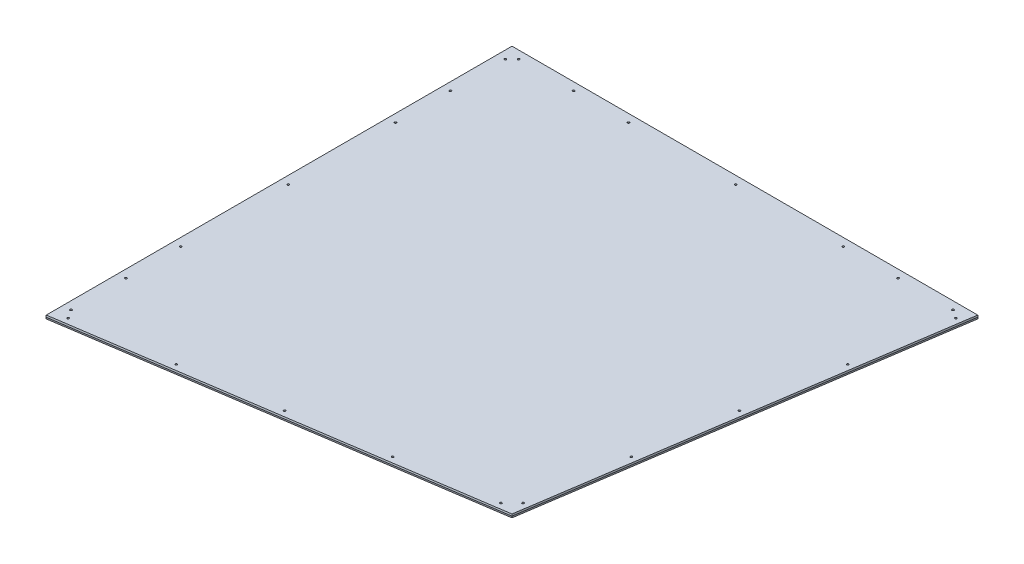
from build123d import *

# Parameters (mm, degrees)
BOSS_EXTRUDE1_DEPTH = 4.365625
CUT_EXTRUDE1_DEPTH  = 1735.31970977
CUT_EXTRUDE2_DEPTH  = 1735.31970977
SKETCH5_R           = 2.57937
CUT_EXTRUDE3_DEPTH  = 1716.251141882


with BuildPart() as part:
    # Sketch2 → Boss-Extrude1 (new, symmetric)
    with BuildSketch(Plane(origin=(0, 0, 0), x_dir=(1, 0, 0), z_dir=(0, 1, 0))):
        Polygon((0, 0), (0, -1212.85), (1055.067217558, -1055.067217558), (1212.85, 0), align=None)
    extrude(amount=BOSS_EXTRUDE1_DEPTH, both=True)

    # Sketch3 → Cut-Extrude1 (cut, through all, along a direction that is not the sketch's normal)
    with BuildSketch(Plane.ZY):
        Polygon((1212.85, 0), (1212.197131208, 4.365625), (1215.39, 4.365625), (1215.39, -4.365625), (1212.197131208, -4.365625), align=None)
    extrude(amount=-CUT_EXTRUDE1_DEPTH, dir=(-0.9890018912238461, 0, 0.14790287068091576), mode=Mode.SUBTRACT)

    # Sketch4 → Cut-Extrude2 (cut, through all, along a direction that is not the sketch's normal)
    with BuildSketch(Plane(origin=(0, 0, 0), x_dir=(-1, 0, 0), z_dir=(0, 0, -1))):
        Polygon((-1212.85, 0), (-1212.197131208, 4.365625), (-1215.39, 4.365625), (-1215.39, -4.365625), (-1212.197131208, -4.365625), align=None)
    extrude(amount=-CUT_EXTRUDE2_DEPTH, dir=(0.1479028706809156, 0, -0.9890018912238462), mode=Mode.SUBTRACT)

    # Sketch5 → Cut-Extrude3 (cut, through all)
    with BuildSketch(Plane.XZ.offset(4.365625)):
        with Locations(Location((35.676546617, 1190.758565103, 0), (0, 0, 270))):
            Circle(SKETCH5_R)
        with Locations(Location((20.6248, 1168.4, 0), (0, 0, 270))):
            Circle(SKETCH5_R)
        with Locations(Location((20.6248, 1025.525, 0), (0, 0, 270))):
            Circle(SKETCH5_R)
        with Locations(Location((280.602864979, 1154.130419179, 0), (0, 0, 270))):
            Circle(SKETCH5_R)
        with Locations(Location((525.52918334, 1117.502273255, 0), (0, 0, 270))):
            Circle(SKETCH5_R)
        with Locations(Location((770.455501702, 1080.87412733, 0), (0, 0, 270))):
            Circle(SKETCH5_R)
        with Locations(Location((1015.381820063, 1044.245981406, 0), (0, 0, 270))):
            Circle(SKETCH5_R)
        with Locations(Location((1044.245981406, 1015.381820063, 0), (0, 0, 270))):
            Circle(SKETCH5_R)
        with Locations(Location((1080.87412733, 770.455501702, 0), (0, 0, 270))):
            Circle(SKETCH5_R)
        with Locations(Location((1117.502273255, 525.52918334, 0), (0, 0, 270))):
            Circle(SKETCH5_R)
        with Locations(Location((1154.130419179, 280.602864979, 0), (0, 0, 270))):
            Circle(SKETCH5_R)
        with Locations(Location((1168.4, 20.6248, 0), (0, 0, 270))):
            Circle(SKETCH5_R)
        with Locations(Location((1190.758565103, 35.676546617, 0), (0, 0, 270))):
            Circle(SKETCH5_R)
        with Locations(Location((1025.525, 20.6248, 0), (0, 0, 270))):
            Circle(SKETCH5_R)
        with Locations(Location((882.65, 20.6248, 0), (0, 0, 270))):
            Circle(SKETCH5_R)
        with Locations(Location((603.25, 20.6248, 0), (0, 0, 270))):
            Circle(SKETCH5_R)
        with Locations(Location((323.85, 20.6248, 0), (0, 0, 270))):
            Circle(SKETCH5_R)
        with Locations(Location((180.975, 20.6248, 0), (0, 0, 270))):
            Circle(SKETCH5_R)
        with Locations(Location((38.1, 20.6248, 0), (0, 0, 270))):
            Circle(SKETCH5_R)
        with Locations(Location((20.6248, 38.1, 0), (0, 0, 270))):
            Circle(SKETCH5_R)
        with Locations(Location((20.6248, 180.975, 0), (0, 0, 270))):
            Circle(SKETCH5_R)
        with Locations(Location((20.6248, 323.85, 0), (0, 0, 270))):
            Circle(SKETCH5_R)
        with Locations(Location((20.6248, 603.25, 0), (0, 0, 270))):
            Circle(SKETCH5_R)
        with Locations(Location((20.6248, 882.65, 0), (0, 0, 270))):
            Circle(SKETCH5_R)
    extrude(amount=-CUT_EXTRUDE3_DEPTH, mode=Mode.SUBTRACT)


solid = part.part
